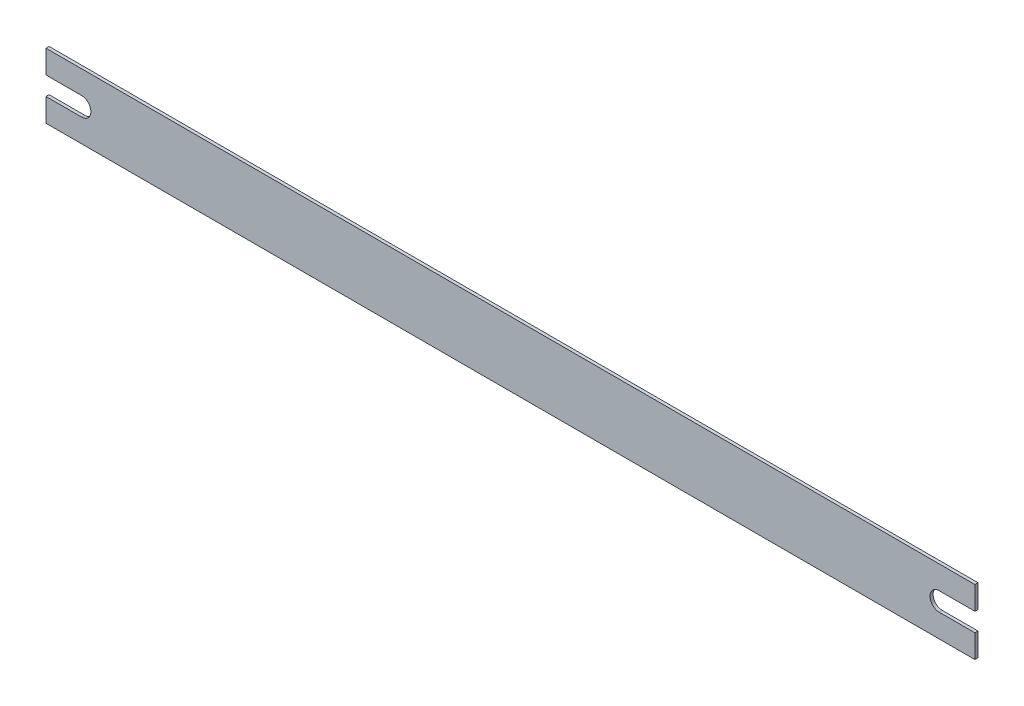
ISO-10303-21;
HEADER;
FILE_DESCRIPTION(('STEP AP214'),'2;1');
FILE_NAME('part.step','',(''),(''),'','','');
FILE_SCHEMA(('AUTOMOTIVE_DESIGN { 1 0 10303 214 1 1 1 1 }'));
ENDSEC;
DATA;
#1=APPLICATION_CONTEXT('core data for automotive mechanical design processes');
#2=APPLICATION_PROTOCOL_DEFINITION('international standard','automotive_design',2000,#1);
#3=PRODUCT_CONTEXT('',#1,'mechanical');
#4=PRODUCT('Part','Part','',(#3));
#5=PRODUCT_RELATED_PRODUCT_CATEGORY('part','',(#4));
#6=PRODUCT_DEFINITION_FORMATION('','',#4);
#7=PRODUCT_DEFINITION_CONTEXT('part definition',#1,'design');
#8=PRODUCT_DEFINITION('design','',#6,#7);
#9=PRODUCT_DEFINITION_SHAPE('','',#8);
#10=(LENGTH_UNIT() NAMED_UNIT(*) SI_UNIT(.MILLI.,.METRE.));
#11=(NAMED_UNIT(*) PLANE_ANGLE_UNIT() SI_UNIT($,.RADIAN.));
#12=(NAMED_UNIT(*) SI_UNIT($,.STERADIAN.) SOLID_ANGLE_UNIT());
#13=UNCERTAINTY_MEASURE_WITH_UNIT(LENGTH_MEASURE(1.E-05),#10,'distance_accuracy_value','');
#14=(GEOMETRIC_REPRESENTATION_CONTEXT(3) GLOBAL_UNCERTAINTY_ASSIGNED_CONTEXT((#13)) GLOBAL_UNIT_ASSIGNED_CONTEXT((#10,
#11,#12)) REPRESENTATION_CONTEXT('',''));
#15=CARTESIAN_POINT('',(0.,0.,0.));
#16=DIRECTION('',(0.,0.,1.));
#17=DIRECTION('',(1.,0.,0.));
#18=AXIS2_PLACEMENT_3D('',#15,#16,#17);
#19=CARTESIAN_POINT('',(1442.5,52.5,5.));
#20=DIRECTION('',(0.,0.,-1.));
#21=DIRECTION('',(-1.,0.,0.));
#22=AXIS2_PLACEMENT_3D('',#19,#20,#21);
#23=CYLINDRICAL_SURFACE('',#22,15.);
#24=CARTESIAN_POINT('',(1442.5,52.5,0.));
#25=DIRECTION('',(0.,0.,1.));
#26=DIRECTION('',(1.,0.,0.));
#27=AXIS2_PLACEMENT_3D('',#24,#25,#26);
#28=CIRCLE('',#27,15.);
#29=CARTESIAN_POINT('',(1442.5,67.5000000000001,0.));
#30=VERTEX_POINT('',#29);
#31=CARTESIAN_POINT('',(1442.5,37.5000000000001,0.));
#32=VERTEX_POINT('',#31);
#33=EDGE_CURVE('E128',#30,#32,#28,.T.);
#34=ORIENTED_EDGE('',*,*,#33,.F.);
#35=DIRECTION('',(0.,0.,-1.));
#36=VECTOR('',#35,1.);
#37=CARTESIAN_POINT('',(1442.5,67.5000000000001,5.));
#38=LINE('',#37,#36);
#39=CARTESIAN_POINT('',(1442.5,67.5000000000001,5.));
#40=VERTEX_POINT('',#39);
#41=EDGE_CURVE('E11',#40,#30,#38,.T.);
#42=ORIENTED_EDGE('',*,*,#41,.F.);
#43=CARTESIAN_POINT('',(1442.5,52.5,5.));
#44=DIRECTION('',(0.,0.,1.));
#45=DIRECTION('',(1.,0.,0.));
#46=AXIS2_PLACEMENT_3D('',#43,#44,#45);
#47=CIRCLE('',#46,15.);
#48=CARTESIAN_POINT('',(1442.5,37.5000000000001,5.));
#49=VERTEX_POINT('',#48);
#50=EDGE_CURVE('E160',#40,#49,#47,.T.);
#51=ORIENTED_EDGE('',*,*,#50,.T.);
#52=DIRECTION('',(0.,0.,-1.));
#53=VECTOR('',#52,1.);
#54=CARTESIAN_POINT('',(1442.5,37.5000000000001,5.));
#55=LINE('',#54,#53);
#56=EDGE_CURVE('E40',#49,#32,#55,.T.);
#57=ORIENTED_EDGE('',*,*,#56,.T.);
#58=EDGE_LOOP('',(#34,#42,#51,#57));
#59=FACE_BOUND('',#58,.T.);
#60=ADVANCED_FACE('F26',(#59),#23,.F.);
#61=CARTESIAN_POINT('',(765.,67.5000000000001,5.));
#62=DIRECTION('',(0.,1.,0.));
#63=DIRECTION('',(0.,0.,1.));
#64=AXIS2_PLACEMENT_3D('',#61,#62,#63);
#65=PLANE('',#64);
#66=DIRECTION('',(1.,0.,0.));
#67=VECTOR('',#66,1.);
#68=CARTESIAN_POINT('',(765.,67.5000000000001,0.));
#69=LINE('',#68,#67);
#70=CARTESIAN_POINT('',(1500.,67.5000000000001,0.));
#71=VERTEX_POINT('',#70);
#72=EDGE_CURVE('E117',#30,#71,#69,.T.);
#73=ORIENTED_EDGE('',*,*,#72,.T.);
#74=DIRECTION('',(0.,0.,-1.));
#75=VECTOR('',#74,1.);
#76=CARTESIAN_POINT('',(1500.,67.5000000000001,5.));
#77=LINE('',#76,#75);
#78=CARTESIAN_POINT('',(1500.,67.5000000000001,5.));
#79=VERTEX_POINT('',#78);
#80=EDGE_CURVE('E33',#79,#71,#77,.T.);
#81=ORIENTED_EDGE('',*,*,#80,.F.);
#82=DIRECTION('',(1.,0.,0.));
#83=VECTOR('',#82,1.);
#84=CARTESIAN_POINT('',(765.,67.5000000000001,5.));
#85=LINE('',#84,#83);
#86=EDGE_CURVE('E119',#40,#79,#85,.T.);
#87=ORIENTED_EDGE('',*,*,#86,.F.);
#88=ORIENTED_EDGE('',*,*,#41,.T.);
#89=EDGE_LOOP('',(#73,#81,#87,#88));
#90=FACE_BOUND('',#89,.T.);
#91=ADVANCED_FACE('F115',(#90),#65,.F.);
#92=CARTESIAN_POINT('',(1500.,-1163.78208961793,5.));
#93=DIRECTION('',(-1.,0.,0.));
#94=DIRECTION('',(0.,0.,1.));
#95=AXIS2_PLACEMENT_3D('',#92,#93,#94);
#96=PLANE('',#95);
#97=DIRECTION('',(0.,1.,0.));
#98=VECTOR('',#97,1.);
#99=CARTESIAN_POINT('',(1500.,-1163.78208961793,0.));
#100=LINE('',#99,#98);
#101=CARTESIAN_POINT('',(1500.,105.,0.));
#102=VERTEX_POINT('',#101);
#103=EDGE_CURVE('E131',#71,#102,#100,.T.);
#104=ORIENTED_EDGE('',*,*,#103,.T.);
#105=DIRECTION('',(0.,0.,-1.));
#106=VECTOR('',#105,1.);
#107=CARTESIAN_POINT('',(1500.,105.,5.));
#108=LINE('',#107,#106);
#109=CARTESIAN_POINT('',(1500.,105.,5.));
#110=VERTEX_POINT('',#109);
#111=EDGE_CURVE('E205',#110,#102,#108,.T.);
#112=ORIENTED_EDGE('',*,*,#111,.F.);
#113=DIRECTION('',(0.,1.,0.));
#114=VECTOR('',#113,1.);
#115=CARTESIAN_POINT('',(1500.,-1163.78208961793,5.));
#116=LINE('',#115,#114);
#117=EDGE_CURVE('E163',#79,#110,#116,.T.);
#118=ORIENTED_EDGE('',*,*,#117,.F.);
#119=ORIENTED_EDGE('',*,*,#80,.T.);
#120=EDGE_LOOP('',(#104,#112,#118,#119));
#121=FACE_BOUND('',#120,.T.);
#122=ADVANCED_FACE('F208',(#121),#96,.F.);
#123=CARTESIAN_POINT('',(765.,105.,5.));
#124=DIRECTION('',(0.,1.,0.));
#125=DIRECTION('',(0.,0.,1.));
#126=AXIS2_PLACEMENT_3D('',#123,#124,#125);
#127=PLANE('',#126);
#128=DIRECTION('',(1.,0.,0.));
#129=VECTOR('',#128,1.);
#130=CARTESIAN_POINT('',(765.,105.,0.));
#131=LINE('',#130,#129);
#132=CARTESIAN_POINT('',(0.,105.,0.));
#133=VERTEX_POINT('',#132);
#134=EDGE_CURVE('E136',#133,#102,#131,.T.);
#135=ORIENTED_EDGE('',*,*,#134,.F.);
#136=DIRECTION('',(0.,0.,-1.));
#137=VECTOR('',#136,1.);
#138=CARTESIAN_POINT('',(0.,105.,5.));
#139=LINE('',#138,#137);
#140=CARTESIAN_POINT('',(0.,105.,5.));
#141=VERTEX_POINT('',#140);
#142=EDGE_CURVE('E203',#141,#133,#139,.T.);
#143=ORIENTED_EDGE('',*,*,#142,.F.);
#144=DIRECTION('',(1.,0.,0.));
#145=VECTOR('',#144,1.);
#146=CARTESIAN_POINT('',(765.,105.,5.));
#147=LINE('',#146,#145);
#148=EDGE_CURVE('E165',#141,#110,#147,.T.);
#149=ORIENTED_EDGE('',*,*,#148,.T.);
#150=ORIENTED_EDGE('',*,*,#111,.T.);
#151=EDGE_LOOP('',(#135,#143,#149,#150));
#152=FACE_BOUND('',#151,.T.);
#153=ADVANCED_FACE('F243',(#152),#127,.T.);
#154=CARTESIAN_POINT('',(0.,-1163.78208961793,5.));
#155=DIRECTION('',(-1.,0.,0.));
#156=DIRECTION('',(0.,0.,1.));
#157=AXIS2_PLACEMENT_3D('',#154,#155,#156);
#158=PLANE('',#157);
#159=DIRECTION('',(0.,1.,0.));
#160=VECTOR('',#159,1.);
#161=CARTESIAN_POINT('',(0.,-1163.78208961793,0.));
#162=LINE('',#161,#160);
#163=CARTESIAN_POINT('',(0.,67.5000000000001,0.));
#164=VERTEX_POINT('',#163);
#165=EDGE_CURVE('E138',#164,#133,#162,.T.);
#166=ORIENTED_EDGE('',*,*,#165,.F.);
#167=DIRECTION('',(0.,0.,-1.));
#168=VECTOR('',#167,1.);
#169=CARTESIAN_POINT('',(0.,67.5000000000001,5.));
#170=LINE('',#169,#168);
#171=CARTESIAN_POINT('',(0.,67.5000000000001,5.));
#172=VERTEX_POINT('',#171);
#173=EDGE_CURVE('E201',#172,#164,#170,.T.);
#174=ORIENTED_EDGE('',*,*,#173,.F.);
#175=DIRECTION('',(0.,1.,0.));
#176=VECTOR('',#175,1.);
#177=CARTESIAN_POINT('',(0.,-1163.78208961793,5.));
#178=LINE('',#177,#176);
#179=EDGE_CURVE('E168',#172,#141,#178,.T.);
#180=ORIENTED_EDGE('',*,*,#179,.T.);
#181=ORIENTED_EDGE('',*,*,#142,.T.);
#182=EDGE_LOOP('',(#166,#174,#180,#181));
#183=FACE_BOUND('',#182,.T.);
#184=ADVANCED_FACE('F240',(#183),#158,.T.);
#185=CARTESIAN_POINT('',(765.,67.5000000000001,5.));
#186=DIRECTION('',(0.,1.,0.));
#187=DIRECTION('',(0.,0.,1.));
#188=AXIS2_PLACEMENT_3D('',#185,#186,#187);
#189=PLANE('',#188);
#190=DIRECTION('',(1.,0.,0.));
#191=VECTOR('',#190,1.);
#192=CARTESIAN_POINT('',(765.,67.5000000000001,0.));
#193=LINE('',#192,#191);
#194=CARTESIAN_POINT('',(57.5,67.5000000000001,0.));
#195=VERTEX_POINT('',#194);
#196=EDGE_CURVE('E141',#164,#195,#193,.T.);
#197=ORIENTED_EDGE('',*,*,#196,.T.);
#198=DIRECTION('',(0.,0.,-1.));
#199=VECTOR('',#198,1.);
#200=CARTESIAN_POINT('',(57.5,67.5000000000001,5.));
#201=LINE('',#200,#199);
#202=CARTESIAN_POINT('',(57.5,67.5000000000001,5.));
#203=VERTEX_POINT('',#202);
#204=EDGE_CURVE('E199',#203,#195,#201,.T.);
#205=ORIENTED_EDGE('',*,*,#204,.F.);
#206=DIRECTION('',(1.,0.,0.));
#207=VECTOR('',#206,1.);
#208=CARTESIAN_POINT('',(765.,67.5000000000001,5.));
#209=LINE('',#208,#207);
#210=EDGE_CURVE('E171',#172,#203,#209,.T.);
#211=ORIENTED_EDGE('',*,*,#210,.F.);
#212=ORIENTED_EDGE('',*,*,#173,.T.);
#213=EDGE_LOOP('',(#197,#205,#211,#212));
#214=FACE_BOUND('',#213,.T.);
#215=ADVANCED_FACE('F238',(#214),#189,.F.);
#216=CARTESIAN_POINT('',(57.5,52.5,5.));
#217=DIRECTION('',(0.,0.,-1.));
#218=DIRECTION('',(-1.,0.,0.));
#219=AXIS2_PLACEMENT_3D('',#216,#217,#218);
#220=CYLINDRICAL_SURFACE('',#219,15.);
#221=CARTESIAN_POINT('',(57.5,52.5,0.));
#222=DIRECTION('',(0.,0.,1.));
#223=DIRECTION('',(1.,0.,0.));
#224=AXIS2_PLACEMENT_3D('',#221,#222,#223);
#225=CIRCLE('',#224,15.);
#226=CARTESIAN_POINT('',(57.5,37.5000000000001,0.));
#227=VERTEX_POINT('',#226);
#228=EDGE_CURVE('E144',#227,#195,#225,.T.);
#229=ORIENTED_EDGE('',*,*,#228,.F.);
#230=DIRECTION('',(0.,0.,-1.));
#231=VECTOR('',#230,1.);
#232=CARTESIAN_POINT('',(57.5,37.5000000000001,5.));
#233=LINE('',#232,#231);
#234=CARTESIAN_POINT('',(57.5,37.5000000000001,5.));
#235=VERTEX_POINT('',#234);
#236=EDGE_CURVE('E197',#235,#227,#233,.T.);
#237=ORIENTED_EDGE('',*,*,#236,.F.);
#238=CARTESIAN_POINT('',(57.5,52.5,5.));
#239=DIRECTION('',(0.,0.,1.));
#240=DIRECTION('',(1.,0.,0.));
#241=AXIS2_PLACEMENT_3D('',#238,#239,#240);
#242=CIRCLE('',#241,15.);
#243=EDGE_CURVE('E173',#235,#203,#242,.T.);
#244=ORIENTED_EDGE('',*,*,#243,.T.);
#245=ORIENTED_EDGE('',*,*,#204,.T.);
#246=EDGE_LOOP('',(#229,#237,#244,#245));
#247=FACE_BOUND('',#246,.T.);
#248=ADVANCED_FACE('F233',(#247),#220,.F.);
#249=CARTESIAN_POINT('',(765.,37.5000000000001,5.));
#250=DIRECTION('',(0.,1.,0.));
#251=DIRECTION('',(0.,0.,1.));
#252=AXIS2_PLACEMENT_3D('',#249,#250,#251);
#253=PLANE('',#252);
#254=DIRECTION('',(1.,0.,0.));
#255=VECTOR('',#254,1.);
#256=CARTESIAN_POINT('',(765.,37.5000000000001,0.));
#257=LINE('',#256,#255);
#258=CARTESIAN_POINT('',(0.,37.5000000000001,0.));
#259=VERTEX_POINT('',#258);
#260=EDGE_CURVE('E147',#259,#227,#257,.T.);
#261=ORIENTED_EDGE('',*,*,#260,.F.);
#262=DIRECTION('',(0.,0.,-1.));
#263=VECTOR('',#262,1.);
#264=CARTESIAN_POINT('',(0.,37.5000000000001,5.));
#265=LINE('',#264,#263);
#266=CARTESIAN_POINT('',(0.,37.5000000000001,5.));
#267=VERTEX_POINT('',#266);
#268=EDGE_CURVE('E195',#267,#259,#265,.T.);
#269=ORIENTED_EDGE('',*,*,#268,.F.);
#270=DIRECTION('',(1.,0.,0.));
#271=VECTOR('',#270,1.);
#272=CARTESIAN_POINT('',(765.,37.5000000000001,5.));
#273=LINE('',#272,#271);
#274=EDGE_CURVE('E176',#267,#235,#273,.T.);
#275=ORIENTED_EDGE('',*,*,#274,.T.);
#276=ORIENTED_EDGE('',*,*,#236,.T.);
#277=EDGE_LOOP('',(#261,#269,#275,#276));
#278=FACE_BOUND('',#277,.T.);
#279=ADVANCED_FACE('F228',(#278),#253,.T.);
#280=CARTESIAN_POINT('',(0.,-1163.78208961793,5.));
#281=DIRECTION('',(-1.,0.,0.));
#282=DIRECTION('',(0.,0.,1.));
#283=AXIS2_PLACEMENT_3D('',#280,#281,#282);
#284=PLANE('',#283);
#285=DIRECTION('',(0.,1.,0.));
#286=VECTOR('',#285,1.);
#287=CARTESIAN_POINT('',(0.,-1163.78208961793,0.));
#288=LINE('',#287,#286);
#289=CARTESIAN_POINT('',(0.,0.,0.));
#290=VERTEX_POINT('',#289);
#291=EDGE_CURVE('E150',#290,#259,#288,.T.);
#292=ORIENTED_EDGE('',*,*,#291,.F.);
#293=DIRECTION('',(0.,0.,-1.));
#294=VECTOR('',#293,1.);
#295=CARTESIAN_POINT('',(0.,0.,5.));
#296=LINE('',#295,#294);
#297=CARTESIAN_POINT('',(0.,0.,5.));
#298=VERTEX_POINT('',#297);
#299=EDGE_CURVE('E193',#298,#290,#296,.T.);
#300=ORIENTED_EDGE('',*,*,#299,.F.);
#301=DIRECTION('',(0.,1.,0.));
#302=VECTOR('',#301,1.);
#303=CARTESIAN_POINT('',(0.,-1163.78208961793,5.));
#304=LINE('',#303,#302);
#305=EDGE_CURVE('E179',#298,#267,#304,.T.);
#306=ORIENTED_EDGE('',*,*,#305,.T.);
#307=ORIENTED_EDGE('',*,*,#268,.T.);
#308=EDGE_LOOP('',(#292,#300,#306,#307));
#309=FACE_BOUND('',#308,.T.);
#310=ADVANCED_FACE('F222',(#309),#284,.T.);
#311=CARTESIAN_POINT('',(765.,0.,5.));
#312=DIRECTION('',(0.,1.,0.));
#313=DIRECTION('',(0.,0.,1.));
#314=AXIS2_PLACEMENT_3D('',#311,#312,#313);
#315=PLANE('',#314);
#316=DIRECTION('',(1.,0.,0.));
#317=VECTOR('',#316,1.);
#318=CARTESIAN_POINT('',(765.,0.,0.));
#319=LINE('',#318,#317);
#320=CARTESIAN_POINT('',(1500.,0.,0.));
#321=VERTEX_POINT('',#320);
#322=EDGE_CURVE('E153',#290,#321,#319,.T.);
#323=ORIENTED_EDGE('',*,*,#322,.T.);
#324=DIRECTION('',(0.,0.,-1.));
#325=VECTOR('',#324,1.);
#326=CARTESIAN_POINT('',(1500.,0.,5.));
#327=LINE('',#326,#325);
#328=CARTESIAN_POINT('',(1500.,0.,5.));
#329=VERTEX_POINT('',#328);
#330=EDGE_CURVE('E190',#329,#321,#327,.T.);
#331=ORIENTED_EDGE('',*,*,#330,.F.);
#332=DIRECTION('',(1.,0.,0.));
#333=VECTOR('',#332,1.);
#334=CARTESIAN_POINT('',(765.,0.,5.));
#335=LINE('',#334,#333);
#336=EDGE_CURVE('E182',#298,#329,#335,.T.);
#337=ORIENTED_EDGE('',*,*,#336,.F.);
#338=ORIENTED_EDGE('',*,*,#299,.T.);
#339=EDGE_LOOP('',(#323,#331,#337,#338));
#340=FACE_BOUND('',#339,.T.);
#341=ADVANCED_FACE('F293',(#340),#315,.F.);
#342=CARTESIAN_POINT('',(1500.,-1163.78208961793,5.));
#343=DIRECTION('',(-1.,0.,0.));
#344=DIRECTION('',(0.,0.,1.));
#345=AXIS2_PLACEMENT_3D('',#342,#343,#344);
#346=PLANE('',#345);
#347=DIRECTION('',(0.,1.,0.));
#348=VECTOR('',#347,1.);
#349=CARTESIAN_POINT('',(1500.,-1163.78208961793,0.));
#350=LINE('',#349,#348);
#351=CARTESIAN_POINT('',(1500.,37.5000000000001,0.));
#352=VERTEX_POINT('',#351);
#353=EDGE_CURVE('E155',#321,#352,#350,.T.);
#354=ORIENTED_EDGE('',*,*,#353,.T.);
#355=DIRECTION('',(0.,0.,-1.));
#356=VECTOR('',#355,1.);
#357=CARTESIAN_POINT('',(1500.,37.5000000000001,5.));
#358=LINE('',#357,#356);
#359=CARTESIAN_POINT('',(1500.,37.5000000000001,5.));
#360=VERTEX_POINT('',#359);
#361=EDGE_CURVE('E188',#360,#352,#358,.T.);
#362=ORIENTED_EDGE('',*,*,#361,.F.);
#363=DIRECTION('',(0.,1.,0.));
#364=VECTOR('',#363,1.);
#365=CARTESIAN_POINT('',(1500.,-1163.78208961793,5.));
#366=LINE('',#365,#364);
#367=EDGE_CURVE('E48',#329,#360,#366,.T.);
#368=ORIENTED_EDGE('',*,*,#367,.F.);
#369=ORIENTED_EDGE('',*,*,#330,.T.);
#370=EDGE_LOOP('',(#354,#362,#368,#369));
#371=FACE_BOUND('',#370,.T.);
#372=ADVANCED_FACE('F216',(#371),#346,.F.);
#373=CARTESIAN_POINT('',(765.,37.5000000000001,5.));
#374=DIRECTION('',(0.,1.,0.));
#375=DIRECTION('',(0.,0.,1.));
#376=AXIS2_PLACEMENT_3D('',#373,#374,#375);
#377=PLANE('',#376);
#378=DIRECTION('',(1.,0.,0.));
#379=VECTOR('',#378,1.);
#380=CARTESIAN_POINT('',(765.,37.5000000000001,0.));
#381=LINE('',#380,#379);
#382=EDGE_CURVE('E158',#32,#352,#381,.T.);
#383=ORIENTED_EDGE('',*,*,#382,.F.);
#384=ORIENTED_EDGE('',*,*,#56,.F.);
#385=DIRECTION('',(1.,0.,0.));
#386=VECTOR('',#385,1.);
#387=CARTESIAN_POINT('',(765.,37.5000000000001,5.));
#388=LINE('',#387,#386);
#389=EDGE_CURVE('E185',#49,#360,#388,.T.);
#390=ORIENTED_EDGE('',*,*,#389,.T.);
#391=ORIENTED_EDGE('',*,*,#361,.T.);
#392=EDGE_LOOP('',(#383,#384,#390,#391));
#393=FACE_BOUND('',#392,.T.);
#394=ADVANCED_FACE('F213',(#393),#377,.T.);
#395=CARTESIAN_POINT('',(765.,-1163.78208961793,5.));
#396=DIRECTION('',(0.,0.,1.));
#397=DIRECTION('',(1.,0.,0.));
#398=AXIS2_PLACEMENT_3D('',#395,#396,#397);
#399=PLANE('',#398);
#400=ORIENTED_EDGE('',*,*,#50,.F.);
#401=ORIENTED_EDGE('',*,*,#86,.T.);
#402=ORIENTED_EDGE('',*,*,#117,.T.);
#403=ORIENTED_EDGE('',*,*,#148,.F.);
#404=ORIENTED_EDGE('',*,*,#179,.F.);
#405=ORIENTED_EDGE('',*,*,#210,.T.);
#406=ORIENTED_EDGE('',*,*,#243,.F.);
#407=ORIENTED_EDGE('',*,*,#274,.F.);
#408=ORIENTED_EDGE('',*,*,#305,.F.);
#409=ORIENTED_EDGE('',*,*,#336,.T.);
#410=ORIENTED_EDGE('',*,*,#367,.T.);
#411=ORIENTED_EDGE('',*,*,#389,.F.);
#412=EDGE_LOOP('',(#400,#401,#402,#403,#404,#405,#406,#407,#408,#409,#410,#411));
#413=FACE_BOUND('',#412,.T.);
#414=ADVANCED_FACE('F211',(#413),#399,.T.);
#415=CARTESIAN_POINT('',(765.,-1163.78208961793,0.));
#416=DIRECTION('',(0.,0.,1.));
#417=DIRECTION('',(1.,0.,0.));
#418=AXIS2_PLACEMENT_3D('',#415,#416,#417);
#419=PLANE('',#418);
#420=ORIENTED_EDGE('',*,*,#33,.T.);
#421=ORIENTED_EDGE('',*,*,#382,.T.);
#422=ORIENTED_EDGE('',*,*,#353,.F.);
#423=ORIENTED_EDGE('',*,*,#322,.F.);
#424=ORIENTED_EDGE('',*,*,#291,.T.);
#425=ORIENTED_EDGE('',*,*,#260,.T.);
#426=ORIENTED_EDGE('',*,*,#228,.T.);
#427=ORIENTED_EDGE('',*,*,#196,.F.);
#428=ORIENTED_EDGE('',*,*,#165,.T.);
#429=ORIENTED_EDGE('',*,*,#134,.T.);
#430=ORIENTED_EDGE('',*,*,#103,.F.);
#431=ORIENTED_EDGE('',*,*,#72,.F.);
#432=EDGE_LOOP('',(#420,#421,#422,#423,#424,#425,#426,#427,#428,#429,#430,#431));
#433=FACE_BOUND('',#432,.T.);
#434=ADVANCED_FACE('F126',(#433),#419,.F.);
#435=CLOSED_SHELL('',(#60,#91,#122,#153,#184,#215,#248,#279,#310,#341,#372,#394,#414,#434));
#436=MANIFOLD_SOLID_BREP('B2',#435);
#437=ADVANCED_BREP_SHAPE_REPRESENTATION('',(#18,#436),#14);
#438=SHAPE_DEFINITION_REPRESENTATION(#9,#437);
ENDSEC;
END-ISO-10303-21;
